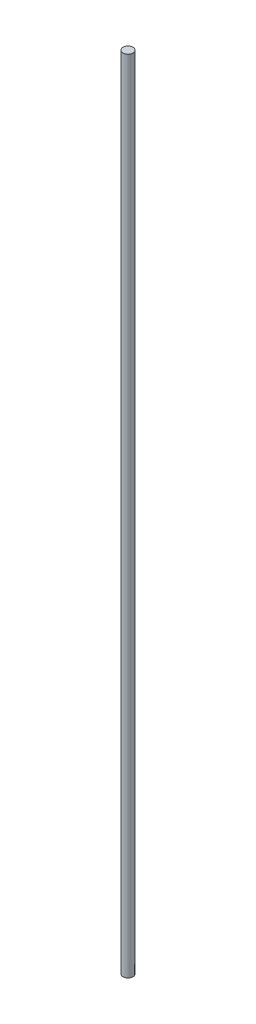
from build123d import *

# Parameters (mm, degrees)
SKETCH_1_R      = 4.826
EXTRUDE_1_DEPTH = 762


with BuildPart() as part:
    # Sketch 1 → Extrude 1 (new body)
    with BuildSketch(Plane(origin=(0, 0, 0), x_dir=(1, 0, 0), z_dir=(0, 1, 0))):
        with Locations(Location((0, 0, 0), (0, 0, 270))):
            Circle(SKETCH_1_R)
    extrude(amount=EXTRUDE_1_DEPTH)


solid = part.part
